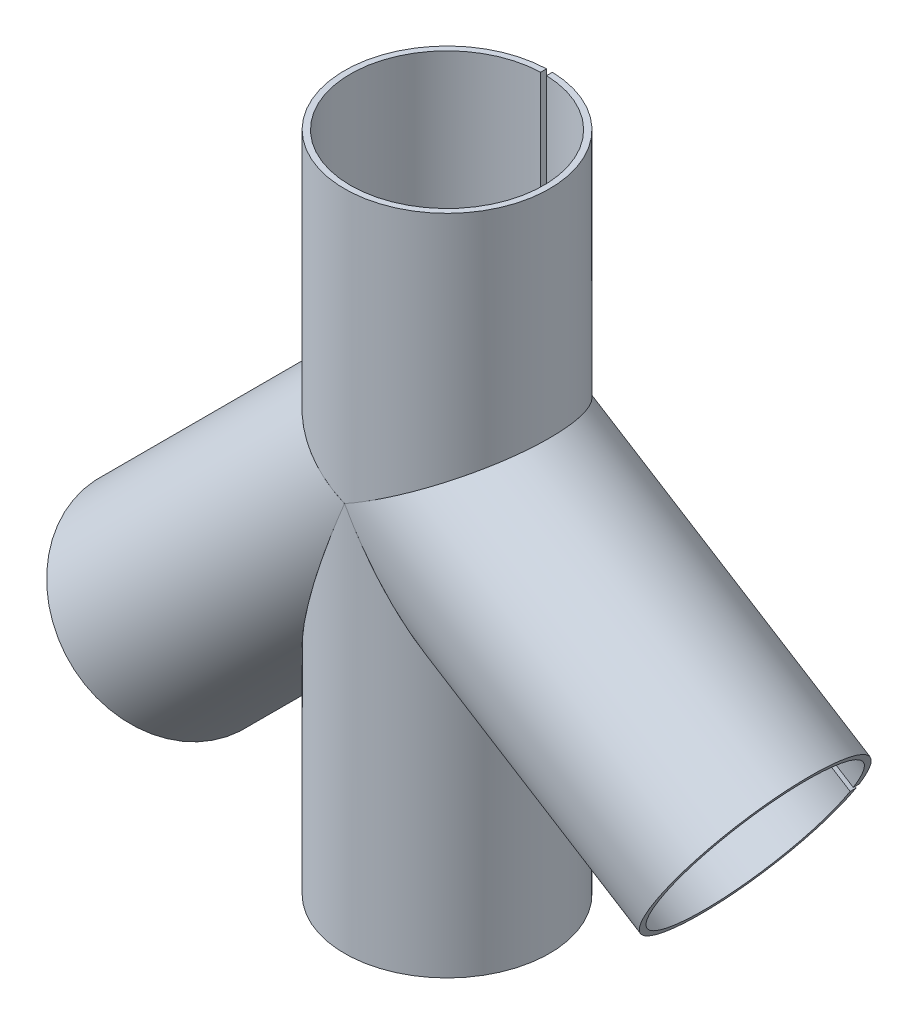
ISO-10303-21;
HEADER;
FILE_DESCRIPTION(('STEP AP214'),'2;1');
FILE_NAME('part.step','',(''),(''),'','','');
FILE_SCHEMA(('AUTOMOTIVE_DESIGN { 1 0 10303 214 1 1 1 1 }'));
ENDSEC;
DATA;
#1=APPLICATION_CONTEXT('core data for automotive mechanical design processes');
#2=APPLICATION_PROTOCOL_DEFINITION('international standard','automotive_design',2000,#1);
#3=PRODUCT_CONTEXT('',#1,'mechanical');
#4=PRODUCT('Part','Part','',(#3));
#5=PRODUCT_RELATED_PRODUCT_CATEGORY('part','',(#4));
#6=PRODUCT_DEFINITION_FORMATION('','',#4);
#7=PRODUCT_DEFINITION_CONTEXT('part definition',#1,'design');
#8=PRODUCT_DEFINITION('design','',#6,#7);
#9=PRODUCT_DEFINITION_SHAPE('','',#8);
#10=(LENGTH_UNIT() NAMED_UNIT(*) SI_UNIT(.MILLI.,.METRE.));
#11=(NAMED_UNIT(*) PLANE_ANGLE_UNIT() SI_UNIT($,.RADIAN.));
#12=(NAMED_UNIT(*) SI_UNIT($,.STERADIAN.) SOLID_ANGLE_UNIT());
#13=UNCERTAINTY_MEASURE_WITH_UNIT(LENGTH_MEASURE(1.E-05),#10,'distance_accuracy_value','');
#14=(GEOMETRIC_REPRESENTATION_CONTEXT(3) GLOBAL_UNCERTAINTY_ASSIGNED_CONTEXT((#13)) GLOBAL_UNIT_ASSIGNED_CONTEXT((#10,
#11,#12)) REPRESENTATION_CONTEXT('',''));
#15=CARTESIAN_POINT('',(0.,0.,0.));
#16=DIRECTION('',(0.,0.,1.));
#17=DIRECTION('',(1.,0.,0.));
#18=AXIS2_PLACEMENT_3D('',#15,#16,#17);
#19=CARTESIAN_POINT('',(0.,-66.,0.));
#20=DIRECTION('',(0.,1.,0.));
#21=DIRECTION('',(0.,0.,1.));
#22=AXIS2_PLACEMENT_3D('',#19,#20,#21);
#23=CYLINDRICAL_SURFACE('',#22,17.3630786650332);
#24=DIRECTION('',(0.,1.,0.));
#25=VECTOR('',#24,1.);
#26=CARTESIAN_POINT('',(0.500000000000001,-66.,-17.3558779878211));
#27=LINE('',#26,#25);
#28=CARTESIAN_POINT('',(0.5,-0.903216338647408,-17.3558779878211));
#29=VERTEX_POINT('',#28);
#30=CARTESIAN_POINT('',(0.500000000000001,-66.,-17.3558779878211));
#31=VERTEX_POINT('',#30);
#32=EDGE_CURVE('E114',#29,#31,#27,.F.);
#33=ORIENTED_EDGE('',*,*,#32,.F.);
#34=CARTESIAN_POINT('',(0.,0.,0.));
#35=DIRECTION('',(0.874891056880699,0.484319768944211,0.));
#36=DIRECTION('',(-0.484319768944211,0.874891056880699,0.));
#37=AXIS2_PLACEMENT_3D('',#34,#35,#36);
#38=ELLIPSE('',#37,35.8504438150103,17.3630786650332);
#39=CARTESIAN_POINT('',(0.,0.,17.3630786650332));
#40=VERTEX_POINT('',#39);
#41=EDGE_CURVE('E159',#29,#40,#38,.F.);
#42=ORIENTED_EDGE('',*,*,#41,.T.);
#43=CARTESIAN_POINT('',(0.,0.,0.));
#44=DIRECTION('',(-0.923879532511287,0.38268343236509,0.));
#45=DIRECTION('',(0.38268343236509,0.923879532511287,0.));
#46=AXIS2_PLACEMENT_3D('',#43,#44,#45);
#47=ELLIPSE('',#46,45.3719110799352,17.3630786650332);
#48=CARTESIAN_POINT('',(-0.499999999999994,-1.20710678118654,-17.3558779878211));
#49=VERTEX_POINT('',#48);
#50=EDGE_CURVE('E138',#40,#49,#47,.F.);
#51=ORIENTED_EDGE('',*,*,#50,.T.);
#52=DIRECTION('',(0.,1.,0.));
#53=VECTOR('',#52,1.);
#54=CARTESIAN_POINT('',(-0.499999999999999,-66.,-17.3558779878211));
#55=LINE('',#54,#53);
#56=CARTESIAN_POINT('',(-0.499999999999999,-66.,-17.3558779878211));
#57=VERTEX_POINT('',#56);
#58=EDGE_CURVE('E85',#49,#57,#55,.F.);
#59=ORIENTED_EDGE('',*,*,#58,.T.);
#60=CARTESIAN_POINT('',(0.,-66.,0.));
#61=DIRECTION('',(0.,1.,0.));
#62=DIRECTION('',(0.,0.,1.));
#63=AXIS2_PLACEMENT_3D('',#60,#61,#62);
#64=CIRCLE('',#63,17.3630786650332);
#65=EDGE_CURVE('E128',#57,#31,#64,.T.);
#66=ORIENTED_EDGE('',*,*,#65,.T.);
#67=EDGE_LOOP('',(#33,#42,#51,#59,#66));
#68=FACE_BOUND('',#67,.T.);
#69=ADVANCED_FACE('F71',(#68),#23,.T.);
#70=CARTESIAN_POINT('',(-17.3630786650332,-41.9181799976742,-17.3630786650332));
#71=DIRECTION('',(-0.923879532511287,0.38268343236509,0.));
#72=DIRECTION('',(-0.38268343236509,-0.923879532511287,0.));
#73=AXIS2_PLACEMENT_3D('',#70,#71,#72);
#74=PLANE('',#73);
#75=CARTESIAN_POINT('',(0.,0.,0.));
#76=DIRECTION('',(-0.923879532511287,0.38268343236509,0.));
#77=DIRECTION('',(0.38268343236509,0.923879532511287,0.));
#78=AXIS2_PLACEMENT_3D('',#75,#76,#77);
#79=ELLIPSE('',#78,42.7587851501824,16.3630786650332);
#80=CARTESIAN_POINT('',(0.,0.,16.3630786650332));
#81=VERTEX_POINT('',#80);
#82=CARTESIAN_POINT('',(-0.499999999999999,-1.20710678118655,-16.3554377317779));
#83=VERTEX_POINT('',#82);
#84=EDGE_CURVE('E136',#81,#83,#79,.F.);
#85=ORIENTED_EDGE('',*,*,#84,.T.);
#86=DIRECTION('',(0.,0.,-1.));
#87=VECTOR('',#86,1.);
#88=CARTESIAN_POINT('',(-0.499999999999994,-1.20710678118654,-17.3630786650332));
#89=LINE('',#88,#87);
#90=EDGE_CURVE('E14',#83,#49,#89,.T.);
#91=ORIENTED_EDGE('',*,*,#90,.T.);
#92=ORIENTED_EDGE('',*,*,#50,.F.);
#93=DIRECTION('',(0.,0.,1.));
#94=VECTOR('',#93,1.);
#95=CARTESIAN_POINT('',(0.,0.,-17.3630786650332));
#96=LINE('',#95,#94);
#97=EDGE_CURVE('E149',#81,#40,#96,.T.);
#98=ORIENTED_EDGE('',*,*,#97,.F.);
#99=EDGE_LOOP('',(#85,#91,#92,#98));
#100=FACE_BOUND('',#99,.T.);
#101=ADVANCED_FACE('F146',(#100),#74,.T.);
#102=CARTESIAN_POINT('',(0.,-66.,0.));
#103=DIRECTION('',(0.,1.,0.));
#104=DIRECTION('',(0.,0.,1.));
#105=AXIS2_PLACEMENT_3D('',#102,#103,#104);
#106=CYLINDRICAL_SURFACE('',#105,16.3630786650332);
#107=CARTESIAN_POINT('',(0.,0.,0.));
#108=DIRECTION('',(0.874891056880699,0.484319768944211,0.));
#109=DIRECTION('',(-0.484319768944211,0.874891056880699,0.));
#110=AXIS2_PLACEMENT_3D('',#107,#108,#109);
#111=ELLIPSE('',#110,33.7856922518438,16.3630786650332);
#112=CARTESIAN_POINT('',(0.5,-0.903216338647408,-16.3554377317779));
#113=VERTEX_POINT('',#112);
#114=EDGE_CURVE('E134',#113,#81,#111,.F.);
#115=ORIENTED_EDGE('',*,*,#114,.F.);
#116=DIRECTION('',(0.,1.,0.));
#117=VECTOR('',#116,1.);
#118=CARTESIAN_POINT('',(0.500000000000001,-66.,-16.3554377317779));
#119=LINE('',#118,#117);
#120=CARTESIAN_POINT('',(0.500000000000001,-66.,-16.3554377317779));
#121=VERTEX_POINT('',#120);
#122=EDGE_CURVE('E92',#113,#121,#119,.F.);
#123=ORIENTED_EDGE('',*,*,#122,.T.);
#124=CARTESIAN_POINT('',(0.,-66.,0.));
#125=DIRECTION('',(0.,1.,0.));
#126=DIRECTION('',(1.,0.,0.));
#127=AXIS2_PLACEMENT_3D('',#124,#125,#126);
#128=CIRCLE('',#127,16.3630786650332);
#129=CARTESIAN_POINT('',(-0.499999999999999,-66.,-16.3554377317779));
#130=VERTEX_POINT('',#129);
#131=EDGE_CURVE('E130',#130,#121,#128,.T.);
#132=ORIENTED_EDGE('',*,*,#131,.F.);
#133=DIRECTION('',(0.,1.,0.));
#134=VECTOR('',#133,1.);
#135=CARTESIAN_POINT('',(-0.499999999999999,-66.,-16.3554377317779));
#136=LINE('',#135,#134);
#137=EDGE_CURVE('E121',#83,#130,#136,.F.);
#138=ORIENTED_EDGE('',*,*,#137,.F.);
#139=ORIENTED_EDGE('',*,*,#84,.F.);
#140=EDGE_LOOP('',(#115,#123,#132,#138,#139));
#141=FACE_BOUND('',#140,.T.);
#142=ADVANCED_FACE('F153',(#141),#106,.F.);
#143=CARTESIAN_POINT('',(0.,-66.,0.));
#144=DIRECTION('',(0.,1.,0.));
#145=DIRECTION('',(0.,0.,1.));
#146=AXIS2_PLACEMENT_3D('',#143,#144,#145);
#147=PLANE('',#146);
#148=ORIENTED_EDGE('',*,*,#131,.T.);
#149=DIRECTION('',(0.,0.,1.));
#150=VECTOR('',#149,1.);
#151=CARTESIAN_POINT('',(0.500000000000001,-66.,-17.3630786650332));
#152=LINE('',#151,#150);
#153=EDGE_CURVE('E117',#31,#121,#152,.T.);
#154=ORIENTED_EDGE('',*,*,#153,.F.);
#155=ORIENTED_EDGE('',*,*,#65,.F.);
#156=DIRECTION('',(0.,0.,1.));
#157=VECTOR('',#156,1.);
#158=CARTESIAN_POINT('',(-0.499999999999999,-66.,-17.3630786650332));
#159=LINE('',#158,#157);
#160=EDGE_CURVE('E131',#57,#130,#159,.T.);
#161=ORIENTED_EDGE('',*,*,#160,.T.);
#162=EDGE_LOOP('',(#148,#154,#155,#161));
#163=FACE_BOUND('',#162,.T.);
#164=ADVANCED_FACE('F126',(#163),#147,.F.);
#165=CARTESIAN_POINT('',(0.,0.,-17.3630786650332));
#166=DIRECTION('',(0.874891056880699,0.484319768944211,0.));
#167=DIRECTION('',(-0.484319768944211,0.874891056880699,0.));
#168=AXIS2_PLACEMENT_3D('',#165,#166,#167);
#169=PLANE('',#168);
#170=DIRECTION('',(0.,0.,-1.));
#171=VECTOR('',#170,1.);
#172=CARTESIAN_POINT('',(0.5,-0.903216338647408,-17.3630786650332));
#173=LINE('',#172,#171);
#174=EDGE_CURVE('E78',#113,#29,#173,.T.);
#175=ORIENTED_EDGE('',*,*,#174,.F.);
#176=ORIENTED_EDGE('',*,*,#114,.T.);
#177=ORIENTED_EDGE('',*,*,#97,.T.);
#178=ORIENTED_EDGE('',*,*,#41,.F.);
#179=EDGE_LOOP('',(#175,#176,#177,#178));
#180=FACE_BOUND('',#179,.T.);
#181=ADVANCED_FACE('F161',(#180),#169,.T.);
#182=CARTESIAN_POINT('',(0.500000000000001,-66.,-17.3630786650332));
#183=DIRECTION('',(1.,0.,0.));
#184=DIRECTION('',(0.,1.,0.));
#185=AXIS2_PLACEMENT_3D('',#182,#183,#184);
#186=PLANE('',#185);
#187=ORIENTED_EDGE('',*,*,#32,.T.);
#188=ORIENTED_EDGE('',*,*,#153,.T.);
#189=ORIENTED_EDGE('',*,*,#122,.F.);
#190=ORIENTED_EDGE('',*,*,#174,.T.);
#191=EDGE_LOOP('',(#187,#188,#189,#190));
#192=FACE_BOUND('',#191,.T.);
#193=ADVANCED_FACE('F116',(#192),#186,.F.);
#194=CARTESIAN_POINT('',(-0.499999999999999,-66.,-17.3630786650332));
#195=DIRECTION('',(1.,0.,0.));
#196=DIRECTION('',(0.,1.,0.));
#197=AXIS2_PLACEMENT_3D('',#194,#195,#196);
#198=PLANE('',#197);
#199=ORIENTED_EDGE('',*,*,#90,.F.);
#200=ORIENTED_EDGE('',*,*,#137,.T.);
#201=ORIENTED_EDGE('',*,*,#160,.F.);
#202=ORIENTED_EDGE('',*,*,#58,.F.);
#203=EDGE_LOOP('',(#199,#200,#201,#202));
#204=FACE_BOUND('',#203,.T.);
#205=ADVANCED_FACE('F168',(#204),#198,.T.);
#206=CLOSED_SHELL('',(#69,#101,#142,#164,#181,#193,#205));
#207=MANIFOLD_SOLID_BREP('B2',#206);
#208=CARTESIAN_POINT('',(0.,0.,0.));
#209=DIRECTION('',(-0.707106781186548,-0.707106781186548,0.));
#210=DIRECTION('',(0.707106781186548,-0.707106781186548,0.));
#211=AXIS2_PLACEMENT_3D('',#208,#209,#210);
#212=CYLINDRICAL_SURFACE('',#211,17.3630786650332);
#213=DIRECTION('',(-0.707106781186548,-0.707106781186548,0.));
#214=VECTOR('',#213,1.);
#215=CARTESIAN_POINT('',(-0.353553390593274,0.353553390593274,-17.3558779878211));
#216=LINE('',#215,#214);
#217=CARTESIAN_POINT('',(-46.9159013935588,-46.2087946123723,-17.3558779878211));
#218=VERTEX_POINT('',#217);
#219=CARTESIAN_POINT('',(-0.5,0.207106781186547,-17.3558779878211));
#220=VERTEX_POINT('',#219);
#221=EDGE_CURVE('E243',#218,#220,#216,.F.);
#222=ORIENTED_EDGE('',*,*,#221,.F.);
#223=CARTESIAN_POINT('',(-46.5623480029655,-46.5623480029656,0.));
#224=DIRECTION('',(-0.707106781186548,-0.707106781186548,0.));
#225=DIRECTION('',(0.707106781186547,-0.707106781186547,0.));
#226=AXIS2_PLACEMENT_3D('',#223,#224,#225);
#227=CIRCLE('',#226,17.3630786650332);
#228=CARTESIAN_POINT('',(-46.2087946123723,-46.9159013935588,-17.3558779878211));
#229=VERTEX_POINT('',#228);
#230=EDGE_CURVE('E287',#229,#218,#227,.T.);
#231=ORIENTED_EDGE('',*,*,#230,.F.);
#232=DIRECTION('',(-0.707106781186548,-0.707106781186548,0.));
#233=VECTOR('',#232,1.);
#234=CARTESIAN_POINT('',(0.353553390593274,-0.353553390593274,-17.3558779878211));
#235=LINE('',#234,#233);
#236=CARTESIAN_POINT('',(-0.499999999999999,-1.20710678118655,-17.3558779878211));
#237=VERTEX_POINT('',#236);
#238=EDGE_CURVE('E273',#229,#237,#235,.F.);
#239=ORIENTED_EDGE('',*,*,#238,.T.);
#240=CARTESIAN_POINT('',(0.,0.,0.));
#241=DIRECTION('',(0.923879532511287,-0.38268343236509,0.));
#242=DIRECTION('',(-0.38268343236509,-0.923879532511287,0.));
#243=AXIS2_PLACEMENT_3D('',#240,#241,#242);
#244=ELLIPSE('',#243,45.3719110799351,17.3630786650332);
#245=CARTESIAN_POINT('',(0.,0.,17.3630786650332));
#246=VERTEX_POINT('',#245);
#247=EDGE_CURVE('E307',#237,#246,#244,.F.);
#248=ORIENTED_EDGE('',*,*,#247,.T.);
#249=CARTESIAN_POINT('',(0.,0.,0.));
#250=DIRECTION('',(0.38268343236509,0.923879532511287,0.));
#251=DIRECTION('',(-0.923879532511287,0.38268343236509,0.));
#252=AXIS2_PLACEMENT_3D('',#249,#250,#251);
#253=ELLIPSE('',#252,18.7936609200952,17.3630786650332);
#254=EDGE_CURVE('E297',#246,#220,#253,.F.);
#255=ORIENTED_EDGE('',*,*,#254,.T.);
#256=EDGE_LOOP('',(#222,#231,#239,#248,#255));
#257=FACE_BOUND('',#256,.T.);
#258=ADVANCED_FACE('F230',(#257),#212,.T.);
#259=CARTESIAN_POINT('',(-17.3630786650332,-41.9181799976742,-17.3630786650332));
#260=DIRECTION('',(0.923879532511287,-0.38268343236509,0.));
#261=DIRECTION('',(0.38268343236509,0.923879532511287,0.));
#262=AXIS2_PLACEMENT_3D('',#259,#260,#261);
#263=PLANE('',#262);
#264=ORIENTED_EDGE('',*,*,#247,.F.);
#265=DIRECTION('',(0.,0.,1.));
#266=VECTOR('',#265,1.);
#267=CARTESIAN_POINT('',(-0.499999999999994,-1.20710678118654,-17.3630786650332));
#268=LINE('',#267,#266);
#269=CARTESIAN_POINT('',(-0.499999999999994,-1.20710678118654,-16.3554377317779));
#270=VERTEX_POINT('',#269);
#271=EDGE_CURVE('E237',#237,#270,#268,.T.);
#272=ORIENTED_EDGE('',*,*,#271,.T.);
#273=CARTESIAN_POINT('',(0.,0.,0.));
#274=DIRECTION('',(0.923879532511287,-0.38268343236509,0.));
#275=DIRECTION('',(-0.38268343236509,-0.923879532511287,0.));
#276=AXIS2_PLACEMENT_3D('',#273,#274,#275);
#277=ELLIPSE('',#276,42.7587851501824,16.3630786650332);
#278=CARTESIAN_POINT('',(0.,0.,16.3630786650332));
#279=VERTEX_POINT('',#278);
#280=EDGE_CURVE('E293',#270,#279,#277,.F.);
#281=ORIENTED_EDGE('',*,*,#280,.T.);
#282=DIRECTION('',(0.,0.,1.));
#283=VECTOR('',#282,1.);
#284=CARTESIAN_POINT('',(0.,0.,-17.3630786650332));
#285=LINE('',#284,#283);
#286=EDGE_CURVE('E315',#279,#246,#285,.T.);
#287=ORIENTED_EDGE('',*,*,#286,.T.);
#288=EDGE_LOOP('',(#264,#272,#281,#287));
#289=FACE_BOUND('',#288,.T.);
#290=ADVANCED_FACE('F304',(#289),#263,.T.);
#291=CARTESIAN_POINT('',(0.,0.,0.));
#292=DIRECTION('',(-0.707106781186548,-0.707106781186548,0.));
#293=DIRECTION('',(0.707106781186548,-0.707106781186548,0.));
#294=AXIS2_PLACEMENT_3D('',#291,#292,#293);
#295=CYLINDRICAL_SURFACE('',#294,16.3630786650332);
#296=CARTESIAN_POINT('',(-46.5623480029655,-46.5623480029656,0.));
#297=DIRECTION('',(-0.707106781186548,-0.707106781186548,0.));
#298=DIRECTION('',(0.707106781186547,-0.707106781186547,0.));
#299=AXIS2_PLACEMENT_3D('',#296,#297,#298);
#300=CIRCLE('',#299,16.3630786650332);
#301=CARTESIAN_POINT('',(-46.2087946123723,-46.9159013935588,-16.3554377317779));
#302=VERTEX_POINT('',#301);
#303=CARTESIAN_POINT('',(-46.9159013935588,-46.2087946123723,-16.3554377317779));
#304=VERTEX_POINT('',#303);
#305=EDGE_CURVE('E289',#302,#304,#300,.T.);
#306=ORIENTED_EDGE('',*,*,#305,.T.);
#307=DIRECTION('',(-0.707106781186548,-0.707106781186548,0.));
#308=VECTOR('',#307,1.);
#309=CARTESIAN_POINT('',(-0.353553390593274,0.353553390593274,-16.3554377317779));
#310=LINE('',#309,#308);
#311=CARTESIAN_POINT('',(-0.5,0.207106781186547,-16.3554377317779));
#312=VERTEX_POINT('',#311);
#313=EDGE_CURVE('E280',#304,#312,#310,.F.);
#314=ORIENTED_EDGE('',*,*,#313,.T.);
#315=CARTESIAN_POINT('',(0.,0.,0.));
#316=DIRECTION('',(0.38268343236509,0.923879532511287,0.));
#317=DIRECTION('',(-0.923879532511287,0.38268343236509,0.));
#318=AXIS2_PLACEMENT_3D('',#315,#316,#317);
#319=ELLIPSE('',#318,17.7112687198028,16.3630786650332);
#320=EDGE_CURVE('E295',#279,#312,#319,.F.);
#321=ORIENTED_EDGE('',*,*,#320,.F.);
#322=ORIENTED_EDGE('',*,*,#280,.F.);
#323=DIRECTION('',(-0.707106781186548,-0.707106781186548,0.));
#324=VECTOR('',#323,1.);
#325=CARTESIAN_POINT('',(0.353553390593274,-0.353553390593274,-16.3554377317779));
#326=LINE('',#325,#324);
#327=EDGE_CURVE('E251',#302,#270,#326,.F.);
#328=ORIENTED_EDGE('',*,*,#327,.F.);
#329=EDGE_LOOP('',(#306,#314,#321,#322,#328));
#330=FACE_BOUND('',#329,.T.);
#331=ADVANCED_FACE('F310',(#330),#295,.F.);
#332=CARTESIAN_POINT('',(-46.5623480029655,-46.5623480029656,0.));
#333=DIRECTION('',(-0.707106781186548,-0.707106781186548,0.));
#334=DIRECTION('',(0.707106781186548,-0.707106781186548,0.));
#335=AXIS2_PLACEMENT_3D('',#332,#333,#334);
#336=PLANE('',#335);
#337=DIRECTION('',(0.,0.,1.));
#338=VECTOR('',#337,1.);
#339=CARTESIAN_POINT('',(-46.9159013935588,-46.2087946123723,-17.3630786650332));
#340=LINE('',#339,#338);
#341=EDGE_CURVE('E290',#218,#304,#340,.T.);
#342=ORIENTED_EDGE('',*,*,#341,.T.);
#343=ORIENTED_EDGE('',*,*,#305,.F.);
#344=DIRECTION('',(0.,0.,1.));
#345=VECTOR('',#344,1.);
#346=CARTESIAN_POINT('',(-46.2087946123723,-46.9159013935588,-17.3630786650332));
#347=LINE('',#346,#345);
#348=EDGE_CURVE('E276',#229,#302,#347,.T.);
#349=ORIENTED_EDGE('',*,*,#348,.F.);
#350=ORIENTED_EDGE('',*,*,#230,.T.);
#351=EDGE_LOOP('',(#342,#343,#349,#350));
#352=FACE_BOUND('',#351,.T.);
#353=ADVANCED_FACE('F286',(#352),#336,.T.);
#354=CARTESIAN_POINT('',(-17.3630786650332,7.1920226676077,-17.3630786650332));
#355=DIRECTION('',(0.38268343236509,0.923879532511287,0.));
#356=DIRECTION('',(-0.923879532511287,0.38268343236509,0.));
#357=AXIS2_PLACEMENT_3D('',#354,#355,#356);
#358=PLANE('',#357);
#359=DIRECTION('',(0.,0.,1.));
#360=VECTOR('',#359,1.);
#361=CARTESIAN_POINT('',(-0.5,0.207106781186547,-17.3630786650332));
#362=LINE('',#361,#360);
#363=EDGE_CURVE('E69',#220,#312,#362,.T.);
#364=ORIENTED_EDGE('',*,*,#363,.F.);
#365=ORIENTED_EDGE('',*,*,#254,.F.);
#366=ORIENTED_EDGE('',*,*,#286,.F.);
#367=ORIENTED_EDGE('',*,*,#320,.T.);
#368=EDGE_LOOP('',(#364,#365,#366,#367));
#369=FACE_BOUND('',#368,.T.);
#370=ADVANCED_FACE('F313',(#369),#358,.T.);
#371=CARTESIAN_POINT('',(0.353553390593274,-0.353553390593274,-17.3630786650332));
#372=DIRECTION('',(-0.707106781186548,0.707106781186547,0.));
#373=DIRECTION('',(-0.707106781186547,-0.707106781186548,0.));
#374=AXIS2_PLACEMENT_3D('',#371,#372,#373);
#375=PLANE('',#374);
#376=ORIENTED_EDGE('',*,*,#348,.T.);
#377=ORIENTED_EDGE('',*,*,#327,.T.);
#378=ORIENTED_EDGE('',*,*,#271,.F.);
#379=ORIENTED_EDGE('',*,*,#238,.F.);
#380=EDGE_LOOP('',(#376,#377,#378,#379));
#381=FACE_BOUND('',#380,.T.);
#382=ADVANCED_FACE('F275',(#381),#375,.T.);
#383=CARTESIAN_POINT('',(-0.353553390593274,0.353553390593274,-17.3630786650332));
#384=DIRECTION('',(-0.707106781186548,0.707106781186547,0.));
#385=DIRECTION('',(-0.707106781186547,-0.707106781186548,0.));
#386=AXIS2_PLACEMENT_3D('',#383,#384,#385);
#387=PLANE('',#386);
#388=ORIENTED_EDGE('',*,*,#221,.T.);
#389=ORIENTED_EDGE('',*,*,#363,.T.);
#390=ORIENTED_EDGE('',*,*,#313,.F.);
#391=ORIENTED_EDGE('',*,*,#341,.F.);
#392=EDGE_LOOP('',(#388,#389,#390,#391));
#393=FACE_BOUND('',#392,.T.);
#394=ADVANCED_FACE('F322',(#393),#387,.F.);
#395=CLOSED_SHELL('',(#258,#290,#331,#353,#370,#382,#394));
#396=MANIFOLD_SOLID_BREP('B8',#395);
#397=CARTESIAN_POINT('',(0.,0.,0.));
#398=DIRECTION('',(0.847454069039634,-0.530868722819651,0.));
#399=DIRECTION('',(0.530868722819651,0.847454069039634,0.));
#400=AXIS2_PLACEMENT_3D('',#397,#398,#399);
#401=CYLINDRICAL_SURFACE('',#400,17.3630786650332);
#402=DIRECTION('',(0.847454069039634,-0.530868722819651,0.));
#403=VECTOR('',#402,1.);
#404=CARTESIAN_POINT('',(0.265434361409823,0.423727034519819,-17.3558779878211));
#405=LINE('',#404,#403);
#406=CARTESIAN_POINT('',(0.5,0.276788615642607,-17.3558779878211));
#407=VERTEX_POINT('',#406);
#408=CARTESIAN_POINT('',(52.4616941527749,-32.2734571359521,-17.3558779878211));
#409=VERTEX_POINT('',#408);
#410=EDGE_CURVE('E473',#407,#409,#405,.T.);
#411=ORIENTED_EDGE('',*,*,#410,.F.);
#412=CARTESIAN_POINT('',(0.,0.,0.));
#413=DIRECTION('',(-0.484319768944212,0.874891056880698,0.));
#414=DIRECTION('',(0.874891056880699,0.484319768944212,0.));
#415=AXIS2_PLACEMENT_3D('',#412,#413,#414);
#416=ELLIPSE('',#415,19.8459894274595,17.3630786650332);
#417=CARTESIAN_POINT('',(0.,0.,17.3630786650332));
#418=VERTEX_POINT('',#417);
#419=EDGE_CURVE('E457',#407,#418,#416,.F.);
#420=ORIENTED_EDGE('',*,*,#419,.T.);
#421=CARTESIAN_POINT('',(0.,0.,0.));
#422=DIRECTION('',(-0.874891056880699,-0.484319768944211,0.));
#423=DIRECTION('',(0.484319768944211,-0.874891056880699,0.));
#424=AXIS2_PLACEMENT_3D('',#421,#422,#423);
#425=ELLIPSE('',#424,35.8504438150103,17.3630786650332);
#426=CARTESIAN_POINT('',(0.5,-0.903216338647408,-17.3558779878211));
#427=VERTEX_POINT('',#426);
#428=EDGE_CURVE('E447',#418,#427,#425,.F.);
#429=ORIENTED_EDGE('',*,*,#428,.T.);
#430=DIRECTION('',(0.847454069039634,-0.530868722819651,0.));
#431=VECTOR('',#430,1.);
#432=CARTESIAN_POINT('',(-0.265434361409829,-0.423727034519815,-17.3558779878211));
#433=LINE('',#432,#431);
#434=CARTESIAN_POINT('',(51.9308254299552,-33.1209112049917,-17.3558779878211));
#435=VERTEX_POINT('',#434);
#436=EDGE_CURVE('E409',#427,#435,#433,.T.);
#437=ORIENTED_EDGE('',*,*,#436,.T.);
#438=CARTESIAN_POINT('',(52.1962597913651,-32.6971841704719,0.));
#439=DIRECTION('',(0.847454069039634,-0.530868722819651,0.));
#440=DIRECTION('',(0.530868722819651,0.847454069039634,0.));
#441=AXIS2_PLACEMENT_3D('',#438,#439,#440);
#442=CIRCLE('',#441,17.3630786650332);
#443=EDGE_CURVE('E445',#409,#435,#442,.T.);
#444=ORIENTED_EDGE('',*,*,#443,.F.);
#445=EDGE_LOOP('',(#411,#420,#429,#437,#444));
#446=FACE_BOUND('',#445,.T.);
#447=ADVANCED_FACE('F388',(#446),#401,.T.);
#448=CARTESIAN_POINT('',(0.,0.,-17.3630786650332));
#449=DIRECTION('',(-0.874891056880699,-0.484319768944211,0.));
#450=DIRECTION('',(0.484319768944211,-0.874891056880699,0.));
#451=AXIS2_PLACEMENT_3D('',#448,#449,#450);
#452=PLANE('',#451);
#453=CARTESIAN_POINT('',(0.,0.,0.));
#454=DIRECTION('',(-0.874891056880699,-0.484319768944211,0.));
#455=DIRECTION('',(0.484319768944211,-0.874891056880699,0.));
#456=AXIS2_PLACEMENT_3D('',#453,#454,#455);
#457=ELLIPSE('',#456,33.7856922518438,16.3630786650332);
#458=CARTESIAN_POINT('',(0.,0.,16.3630786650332));
#459=VERTEX_POINT('',#458);
#460=CARTESIAN_POINT('',(0.5,-0.903216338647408,-16.3554377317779));
#461=VERTEX_POINT('',#460);
#462=EDGE_CURVE('E451',#459,#461,#457,.F.);
#463=ORIENTED_EDGE('',*,*,#462,.T.);
#464=DIRECTION('',(0.,0.,-1.));
#465=VECTOR('',#464,1.);
#466=CARTESIAN_POINT('',(0.5,-0.903216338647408,-17.3630786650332));
#467=LINE('',#466,#465);
#468=EDGE_CURVE('E395',#461,#427,#467,.T.);
#469=ORIENTED_EDGE('',*,*,#468,.T.);
#470=ORIENTED_EDGE('',*,*,#428,.F.);
#471=DIRECTION('',(0.,0.,1.));
#472=VECTOR('',#471,1.);
#473=CARTESIAN_POINT('',(0.,0.,-17.3630786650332));
#474=LINE('',#473,#472);
#475=EDGE_CURVE('E475',#459,#418,#474,.T.);
#476=ORIENTED_EDGE('',*,*,#475,.F.);
#477=EDGE_LOOP('',(#463,#469,#470,#476));
#478=FACE_BOUND('',#477,.T.);
#479=ADVANCED_FACE('F462',(#478),#452,.T.);
#480=CARTESIAN_POINT('',(0.,0.,0.));
#481=DIRECTION('',(0.847454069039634,-0.530868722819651,0.));
#482=DIRECTION('',(0.530868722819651,0.847454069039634,0.));
#483=AXIS2_PLACEMENT_3D('',#480,#481,#482);
#484=CYLINDRICAL_SURFACE('',#483,16.3630786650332);
#485=CARTESIAN_POINT('',(0.,0.,0.));
#486=DIRECTION('',(-0.484319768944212,0.874891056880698,0.));
#487=DIRECTION('',(0.874891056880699,0.484319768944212,0.));
#488=AXIS2_PLACEMENT_3D('',#485,#486,#487);
#489=ELLIPSE('',#488,18.70298997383,16.3630786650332);
#490=CARTESIAN_POINT('',(0.5,0.276788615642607,-16.3554377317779));
#491=VERTEX_POINT('',#490);
#492=EDGE_CURVE('E455',#491,#459,#489,.F.);
#493=ORIENTED_EDGE('',*,*,#492,.F.);
#494=DIRECTION('',(0.847454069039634,-0.530868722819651,0.));
#495=VECTOR('',#494,1.);
#496=CARTESIAN_POINT('',(0.265434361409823,0.423727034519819,-16.3554377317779));
#497=LINE('',#496,#495);
#498=CARTESIAN_POINT('',(52.4616941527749,-32.2734571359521,-16.3554377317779));
#499=VERTEX_POINT('',#498);
#500=EDGE_CURVE('E401',#491,#499,#497,.T.);
#501=ORIENTED_EDGE('',*,*,#500,.T.);
#502=CARTESIAN_POINT('',(52.1962597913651,-32.6971841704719,0.));
#503=DIRECTION('',(0.847454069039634,-0.530868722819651,0.));
#504=DIRECTION('',(0.,0.,-1.));
#505=AXIS2_PLACEMENT_3D('',#502,#503,#504);
#506=CIRCLE('',#505,16.3630786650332);
#507=CARTESIAN_POINT('',(51.9308254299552,-33.1209112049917,-16.3554377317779));
#508=VERTEX_POINT('',#507);
#509=EDGE_CURVE('E452',#499,#508,#506,.T.);
#510=ORIENTED_EDGE('',*,*,#509,.T.);
#511=DIRECTION('',(0.847454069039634,-0.530868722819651,0.));
#512=VECTOR('',#511,1.);
#513=CARTESIAN_POINT('',(-0.265434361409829,-0.423727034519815,-16.3554377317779));
#514=LINE('',#513,#512);
#515=EDGE_CURVE('E434',#461,#508,#514,.T.);
#516=ORIENTED_EDGE('',*,*,#515,.F.);
#517=ORIENTED_EDGE('',*,*,#462,.F.);
#518=EDGE_LOOP('',(#493,#501,#510,#516,#517));
#519=FACE_BOUND('',#518,.T.);
#520=ADVANCED_FACE('F468',(#519),#484,.F.);
#521=CARTESIAN_POINT('',(52.1962597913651,-32.6971841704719,0.));
#522=DIRECTION('',(0.847454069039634,-0.530868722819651,0.));
#523=DIRECTION('',(0.530868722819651,0.847454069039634,0.));
#524=AXIS2_PLACEMENT_3D('',#521,#522,#523);
#525=PLANE('',#524);
#526=DIRECTION('',(0.,0.,1.));
#527=VECTOR('',#526,1.);
#528=CARTESIAN_POINT('',(52.4616941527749,-32.2734571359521,-17.3630786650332));
#529=LINE('',#528,#527);
#530=EDGE_CURVE('E439',#409,#499,#529,.T.);
#531=ORIENTED_EDGE('',*,*,#530,.F.);
#532=ORIENTED_EDGE('',*,*,#443,.T.);
#533=DIRECTION('',(0.,0.,1.));
#534=VECTOR('',#533,1.);
#535=CARTESIAN_POINT('',(51.9308254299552,-33.1209112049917,-17.3630786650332));
#536=LINE('',#535,#534);
#537=EDGE_CURVE('E431',#435,#508,#536,.T.);
#538=ORIENTED_EDGE('',*,*,#537,.T.);
#539=ORIENTED_EDGE('',*,*,#509,.F.);
#540=EDGE_LOOP('',(#531,#532,#538,#539));
#541=FACE_BOUND('',#540,.T.);
#542=ADVANCED_FACE('F450',(#541),#525,.T.);
#543=CARTESIAN_POINT('',(0.,0.,-17.3630786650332));
#544=DIRECTION('',(-0.484319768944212,0.874891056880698,0.));
#545=DIRECTION('',(-0.874891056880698,-0.484319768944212,0.));
#546=AXIS2_PLACEMENT_3D('',#543,#544,#545);
#547=PLANE('',#546);
#548=DIRECTION('',(0.,0.,-1.));
#549=VECTOR('',#548,1.);
#550=CARTESIAN_POINT('',(0.5,0.276788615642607,-17.3630786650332));
#551=LINE('',#550,#549);
#552=EDGE_CURVE('E228',#491,#407,#551,.T.);
#553=ORIENTED_EDGE('',*,*,#552,.F.);
#554=ORIENTED_EDGE('',*,*,#492,.T.);
#555=ORIENTED_EDGE('',*,*,#475,.T.);
#556=ORIENTED_EDGE('',*,*,#419,.F.);
#557=EDGE_LOOP('',(#553,#554,#555,#556));
#558=FACE_BOUND('',#557,.T.);
#559=ADVANCED_FACE('F479',(#558),#547,.T.);
#560=CARTESIAN_POINT('',(-0.265434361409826,-0.423727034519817,-17.3630786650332));
#561=DIRECTION('',(0.530868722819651,0.847454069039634,0.));
#562=DIRECTION('',(-0.847454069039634,0.530868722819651,0.));
#563=AXIS2_PLACEMENT_3D('',#560,#561,#562);
#564=PLANE('',#563);
#565=ORIENTED_EDGE('',*,*,#468,.F.);
#566=ORIENTED_EDGE('',*,*,#515,.T.);
#567=ORIENTED_EDGE('',*,*,#537,.F.);
#568=ORIENTED_EDGE('',*,*,#436,.F.);
#569=EDGE_LOOP('',(#565,#566,#567,#568));
#570=FACE_BOUND('',#569,.T.);
#571=ADVANCED_FACE('F432',(#570),#564,.T.);
#572=CARTESIAN_POINT('',(0.265434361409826,0.423727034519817,-17.3630786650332));
#573=DIRECTION('',(0.530868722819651,0.847454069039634,0.));
#574=DIRECTION('',(-0.847454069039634,0.530868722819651,0.));
#575=AXIS2_PLACEMENT_3D('',#572,#573,#574);
#576=PLANE('',#575);
#577=ORIENTED_EDGE('',*,*,#410,.T.);
#578=ORIENTED_EDGE('',*,*,#530,.T.);
#579=ORIENTED_EDGE('',*,*,#500,.F.);
#580=ORIENTED_EDGE('',*,*,#552,.T.);
#581=EDGE_LOOP('',(#577,#578,#579,#580));
#582=FACE_BOUND('',#581,.T.);
#583=ADVANCED_FACE('F480',(#582),#576,.F.);
#584=CLOSED_SHELL('',(#447,#479,#520,#542,#559,#571,#583));
#585=MANIFOLD_SOLID_BREP('B63',#584);
#586=CARTESIAN_POINT('',(0.,46.170395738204,0.));
#587=DIRECTION('',(0.,-1.,0.));
#588=DIRECTION('',(0.,0.,-1.));
#589=AXIS2_PLACEMENT_3D('',#586,#587,#588);
#590=CYLINDRICAL_SURFACE('',#589,17.3630786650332);
#591=CARTESIAN_POINT('',(0.,0.,0.));
#592=DIRECTION('',(0.484319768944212,-0.874891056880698,0.));
#593=DIRECTION('',(-0.874891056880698,-0.484319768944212,0.));
#594=AXIS2_PLACEMENT_3D('',#591,#592,#593);
#595=ELLIPSE('',#594,19.8459894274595,17.3630786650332);
#596=CARTESIAN_POINT('',(0.5,0.276788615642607,-17.3558779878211));
#597=VERTEX_POINT('',#596);
#598=CARTESIAN_POINT('',(0.,0.,17.3630786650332));
#599=VERTEX_POINT('',#598);
#600=EDGE_CURVE('E606',#597,#599,#595,.T.);
#601=ORIENTED_EDGE('',*,*,#600,.F.);
#602=DIRECTION('',(0.,-1.,0.));
#603=VECTOR('',#602,1.);
#604=CARTESIAN_POINT('',(0.5,46.170395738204,-17.3558779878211));
#605=LINE('',#604,#603);
#606=CARTESIAN_POINT('',(0.5,46.170395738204,-17.3558779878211));
#607=VERTEX_POINT('',#606);
#608=EDGE_CURVE('E550',#597,#607,#605,.F.);
#609=ORIENTED_EDGE('',*,*,#608,.T.);
#610=CARTESIAN_POINT('',(0.,46.170395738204,0.));
#611=DIRECTION('',(0.,1.,0.));
#612=DIRECTION('',(0.,0.,1.));
#613=AXIS2_PLACEMENT_3D('',#610,#611,#612);
#614=CIRCLE('',#613,17.3630786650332);
#615=CARTESIAN_POINT('',(-0.5,46.170395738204,-17.3558779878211));
#616=VERTEX_POINT('',#615);
#617=EDGE_CURVE('E595',#616,#607,#614,.T.);
#618=ORIENTED_EDGE('',*,*,#617,.F.);
#619=DIRECTION('',(0.,-1.,0.));
#620=VECTOR('',#619,1.);
#621=CARTESIAN_POINT('',(-0.5,46.170395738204,-17.3558779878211));
#622=LINE('',#621,#620);
#623=CARTESIAN_POINT('',(-0.5,0.207106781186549,-17.3558779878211));
#624=VERTEX_POINT('',#623);
#625=EDGE_CURVE('E580',#624,#616,#622,.F.);
#626=ORIENTED_EDGE('',*,*,#625,.F.);
#627=CARTESIAN_POINT('',(0.,0.,0.));
#628=DIRECTION('',(-0.38268343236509,-0.923879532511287,0.));
#629=DIRECTION('',(0.923879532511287,-0.38268343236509,0.));
#630=AXIS2_PLACEMENT_3D('',#627,#628,#629);
#631=ELLIPSE('',#630,18.7936609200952,17.3630786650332);
#632=EDGE_CURVE('E615',#599,#624,#631,.T.);
#633=ORIENTED_EDGE('',*,*,#632,.F.);
#634=EDGE_LOOP('',(#601,#609,#618,#626,#633));
#635=FACE_BOUND('',#634,.T.);
#636=ADVANCED_FACE('F537',(#635),#590,.T.);
#637=CARTESIAN_POINT('',(-17.3630786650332,7.1920226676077,-17.3630786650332));
#638=DIRECTION('',(-0.38268343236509,-0.923879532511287,0.));
#639=DIRECTION('',(0.923879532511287,-0.38268343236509,0.));
#640=AXIS2_PLACEMENT_3D('',#637,#638,#639);
#641=PLANE('',#640);
#642=ORIENTED_EDGE('',*,*,#632,.T.);
#643=DIRECTION('',(0.,0.,1.));
#644=VECTOR('',#643,1.);
#645=CARTESIAN_POINT('',(-0.5,0.207106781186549,-17.3630786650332));
#646=LINE('',#645,#644);
#647=CARTESIAN_POINT('',(-0.5,0.207106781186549,-16.355437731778));
#648=VERTEX_POINT('',#647);
#649=EDGE_CURVE('E544',#624,#648,#646,.T.);
#650=ORIENTED_EDGE('',*,*,#649,.T.);
#651=CARTESIAN_POINT('',(0.,0.,0.));
#652=DIRECTION('',(-0.38268343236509,-0.923879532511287,0.));
#653=DIRECTION('',(0.923879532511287,-0.38268343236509,0.));
#654=AXIS2_PLACEMENT_3D('',#651,#652,#653);
#655=ELLIPSE('',#654,17.7112687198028,16.3630786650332);
#656=CARTESIAN_POINT('',(0.,0.,16.3630786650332));
#657=VERTEX_POINT('',#656);
#658=EDGE_CURVE('E601',#657,#648,#655,.T.);
#659=ORIENTED_EDGE('',*,*,#658,.F.);
#660=DIRECTION('',(0.,0.,1.));
#661=VECTOR('',#660,1.);
#662=CARTESIAN_POINT('',(0.,0.,-17.3630786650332));
#663=LINE('',#662,#661);
#664=EDGE_CURVE('E622',#657,#599,#663,.T.);
#665=ORIENTED_EDGE('',*,*,#664,.T.);
#666=EDGE_LOOP('',(#642,#650,#659,#665));
#667=FACE_BOUND('',#666,.T.);
#668=ADVANCED_FACE('F612',(#667),#641,.T.);
#669=CARTESIAN_POINT('',(0.,46.170395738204,0.));
#670=DIRECTION('',(0.,-1.,0.));
#671=DIRECTION('',(0.,0.,-1.));
#672=AXIS2_PLACEMENT_3D('',#669,#670,#671);
#673=CYLINDRICAL_SURFACE('',#672,16.3630786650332);
#674=DIRECTION('',(0.,-1.,0.));
#675=VECTOR('',#674,1.);
#676=CARTESIAN_POINT('',(0.5,46.170395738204,-16.3554377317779));
#677=LINE('',#676,#675);
#678=CARTESIAN_POINT('',(0.5,0.276788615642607,-16.3554377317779));
#679=VERTEX_POINT('',#678);
#680=CARTESIAN_POINT('',(0.5,46.170395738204,-16.3554377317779));
#681=VERTEX_POINT('',#680);
#682=EDGE_CURVE('E588',#679,#681,#677,.F.);
#683=ORIENTED_EDGE('',*,*,#682,.F.);
#684=CARTESIAN_POINT('',(0.,0.,0.));
#685=DIRECTION('',(0.484319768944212,-0.874891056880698,0.));
#686=DIRECTION('',(-0.874891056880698,-0.484319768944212,0.));
#687=AXIS2_PLACEMENT_3D('',#684,#685,#686);
#688=ELLIPSE('',#687,18.70298997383,16.3630786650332);
#689=EDGE_CURVE('E604',#679,#657,#688,.T.);
#690=ORIENTED_EDGE('',*,*,#689,.T.);
#691=ORIENTED_EDGE('',*,*,#658,.T.);
#692=DIRECTION('',(0.,-1.,0.));
#693=VECTOR('',#692,1.);
#694=CARTESIAN_POINT('',(-0.5,46.170395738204,-16.3554377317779));
#695=LINE('',#694,#693);
#696=CARTESIAN_POINT('',(-0.5,46.170395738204,-16.3554377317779));
#697=VERTEX_POINT('',#696);
#698=EDGE_CURVE('E558',#648,#697,#695,.F.);
#699=ORIENTED_EDGE('',*,*,#698,.T.);
#700=CARTESIAN_POINT('',(0.,46.170395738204,0.));
#701=DIRECTION('',(0.,1.,0.));
#702=DIRECTION('',(1.,0.,0.));
#703=AXIS2_PLACEMENT_3D('',#700,#701,#702);
#704=CIRCLE('',#703,16.3630786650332);
#705=EDGE_CURVE('E597',#697,#681,#704,.T.);
#706=ORIENTED_EDGE('',*,*,#705,.T.);
#707=EDGE_LOOP('',(#683,#690,#691,#699,#706));
#708=FACE_BOUND('',#707,.T.);
#709=ADVANCED_FACE('F618',(#708),#673,.F.);
#710=CARTESIAN_POINT('',(0.,46.170395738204,0.));
#711=DIRECTION('',(0.,1.,0.));
#712=DIRECTION('',(0.,0.,1.));
#713=AXIS2_PLACEMENT_3D('',#710,#711,#712);
#714=PLANE('',#713);
#715=DIRECTION('',(0.,0.,1.));
#716=VECTOR('',#715,1.);
#717=CARTESIAN_POINT('',(0.5,46.170395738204,-17.3630786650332));
#718=LINE('',#717,#716);
#719=EDGE_CURVE('E598',#607,#681,#718,.T.);
#720=ORIENTED_EDGE('',*,*,#719,.T.);
#721=ORIENTED_EDGE('',*,*,#705,.F.);
#722=DIRECTION('',(0.,0.,1.));
#723=VECTOR('',#722,1.);
#724=CARTESIAN_POINT('',(-0.5,46.170395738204,-17.3630786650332));
#725=LINE('',#724,#723);
#726=EDGE_CURVE('E583',#616,#697,#725,.T.);
#727=ORIENTED_EDGE('',*,*,#726,.F.);
#728=ORIENTED_EDGE('',*,*,#617,.T.);
#729=EDGE_LOOP('',(#720,#721,#727,#728));
#730=FACE_BOUND('',#729,.T.);
#731=ADVANCED_FACE('F594',(#730),#714,.T.);
#732=CARTESIAN_POINT('',(0.,0.,-17.3630786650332));
#733=DIRECTION('',(0.484319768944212,-0.874891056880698,0.));
#734=DIRECTION('',(0.874891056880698,0.484319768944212,0.));
#735=AXIS2_PLACEMENT_3D('',#732,#733,#734);
#736=PLANE('',#735);
#737=DIRECTION('',(0.,0.,1.));
#738=VECTOR('',#737,1.);
#739=CARTESIAN_POINT('',(0.5,0.276788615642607,-17.3630786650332));
#740=LINE('',#739,#738);
#741=EDGE_CURVE('E386',#597,#679,#740,.T.);
#742=ORIENTED_EDGE('',*,*,#741,.F.);
#743=ORIENTED_EDGE('',*,*,#600,.T.);
#744=ORIENTED_EDGE('',*,*,#664,.F.);
#745=ORIENTED_EDGE('',*,*,#689,.F.);
#746=EDGE_LOOP('',(#742,#743,#744,#745));
#747=FACE_BOUND('',#746,.T.);
#748=ADVANCED_FACE('F621',(#747),#736,.T.);
#749=CARTESIAN_POINT('',(-0.5,0.,-17.3630786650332));
#750=DIRECTION('',(1.,0.,0.));
#751=DIRECTION('',(0.,0.,-1.));
#752=AXIS2_PLACEMENT_3D('',#749,#750,#751);
#753=PLANE('',#752);
#754=ORIENTED_EDGE('',*,*,#625,.T.);
#755=ORIENTED_EDGE('',*,*,#726,.T.);
#756=ORIENTED_EDGE('',*,*,#698,.F.);
#757=ORIENTED_EDGE('',*,*,#649,.F.);
#758=EDGE_LOOP('',(#754,#755,#756,#757));
#759=FACE_BOUND('',#758,.T.);
#760=ADVANCED_FACE('F582',(#759),#753,.T.);
#761=CARTESIAN_POINT('',(0.5,0.,-17.3630786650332));
#762=DIRECTION('',(1.,0.,0.));
#763=DIRECTION('',(0.,0.,-1.));
#764=AXIS2_PLACEMENT_3D('',#761,#762,#763);
#765=PLANE('',#764);
#766=ORIENTED_EDGE('',*,*,#741,.T.);
#767=ORIENTED_EDGE('',*,*,#682,.T.);
#768=ORIENTED_EDGE('',*,*,#719,.F.);
#769=ORIENTED_EDGE('',*,*,#608,.F.);
#770=EDGE_LOOP('',(#766,#767,#768,#769));
#771=FACE_BOUND('',#770,.T.);
#772=ADVANCED_FACE('F629',(#771),#765,.F.);
#773=CLOSED_SHELL('',(#636,#668,#709,#731,#748,#760,#772));
#774=MANIFOLD_SOLID_BREP('B222',#773);
#775=ADVANCED_BREP_SHAPE_REPRESENTATION('',(#18,#207,#396,#585,#774),#14);
#776=SHAPE_DEFINITION_REPRESENTATION(#9,#775);
ENDSEC;
END-ISO-10303-21;
